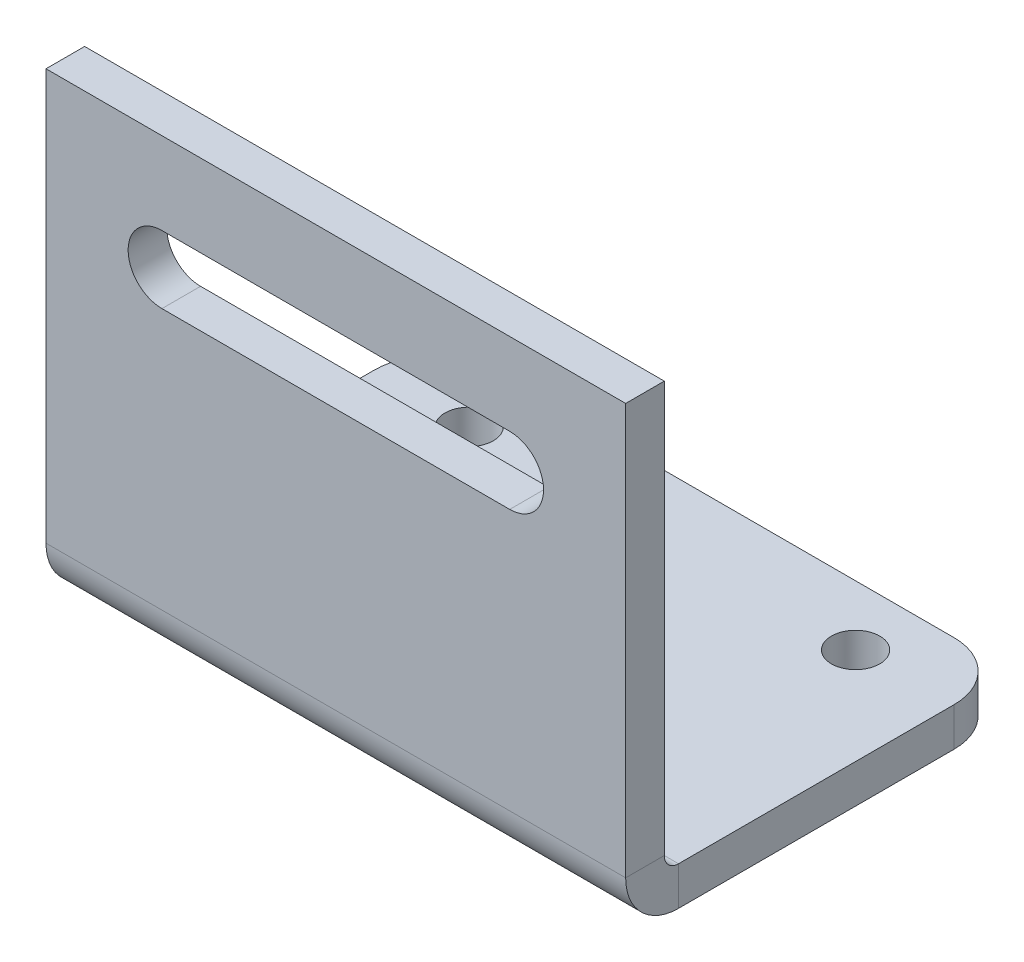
ISO-10303-21;
HEADER;
FILE_DESCRIPTION(('STEP AP214'),'2;1');
FILE_NAME('part.step','',(''),(''),'','','');
FILE_SCHEMA(('AUTOMOTIVE_DESIGN { 1 0 10303 214 1 1 1 1 }'));
ENDSEC;
DATA;
#1=APPLICATION_CONTEXT('core data for automotive mechanical design processes');
#2=APPLICATION_PROTOCOL_DEFINITION('international standard','automotive_design',2000,#1);
#3=PRODUCT_CONTEXT('',#1,'mechanical');
#4=PRODUCT('Part','Part','',(#3));
#5=PRODUCT_RELATED_PRODUCT_CATEGORY('part','',(#4));
#6=PRODUCT_DEFINITION_FORMATION('','',#4);
#7=PRODUCT_DEFINITION_CONTEXT('part definition',#1,'design');
#8=PRODUCT_DEFINITION('design','',#6,#7);
#9=PRODUCT_DEFINITION_SHAPE('','',#8);
#10=(LENGTH_UNIT() NAMED_UNIT(*) SI_UNIT(.MILLI.,.METRE.));
#11=(NAMED_UNIT(*) PLANE_ANGLE_UNIT() SI_UNIT($,.RADIAN.));
#12=(NAMED_UNIT(*) SI_UNIT($,.STERADIAN.) SOLID_ANGLE_UNIT());
#13=UNCERTAINTY_MEASURE_WITH_UNIT(LENGTH_MEASURE(1.E-05),#10,'distance_accuracy_value','');
#14=(GEOMETRIC_REPRESENTATION_CONTEXT(3) GLOBAL_UNCERTAINTY_ASSIGNED_CONTEXT((#13)) GLOBAL_UNIT_ASSIGNED_CONTEXT((#10,
#11,#12)) REPRESENTATION_CONTEXT('',''));
#15=CARTESIAN_POINT('',(0.,0.,0.));
#16=DIRECTION('',(0.,0.,1.));
#17=DIRECTION('',(1.,0.,0.));
#18=AXIS2_PLACEMENT_3D('',#15,#16,#17);
#19=CARTESIAN_POINT('',(146.842788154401,-1.98866400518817E-11,-2.));
#20=DIRECTION('',(-1.,0.,0.));
#21=DIRECTION('',(0.,0.,1.));
#22=AXIS2_PLACEMENT_3D('',#19,#20,#21);
#23=PLANE('',#22);
#24=DIRECTION('',(0.,-1.,0.));
#25=VECTOR('',#24,1.);
#26=CARTESIAN_POINT('',(146.842788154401,-1.98866400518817E-11,-2.));
#27=LINE('',#26,#25);
#28=CARTESIAN_POINT('',(146.842788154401,-1.98866400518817E-11,-2.));
#29=VERTEX_POINT('',#28);
#30=CARTESIAN_POINT('',(146.842788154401,-21.2634000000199,-2.));
#31=VERTEX_POINT('',#30);
#32=EDGE_CURVE('E221',#29,#31,#27,.T.);
#33=ORIENTED_EDGE('',*,*,#32,.T.);
#34=DIRECTION('',(0.,0.,1.));
#35=VECTOR('',#34,1.);
#36=CARTESIAN_POINT('',(146.842788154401,-21.2634000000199,-2.));
#37=LINE('',#36,#35);
#38=CARTESIAN_POINT('',(146.842788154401,-21.2634000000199,0.));
#39=VERTEX_POINT('',#38);
#40=EDGE_CURVE('E205',#31,#39,#37,.T.);
#41=ORIENTED_EDGE('',*,*,#40,.T.);
#42=DIRECTION('',(0.,-1.,0.));
#43=VECTOR('',#42,1.);
#44=CARTESIAN_POINT('',(146.842788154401,-1.98866400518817E-11,0.));
#45=LINE('',#44,#43);
#46=CARTESIAN_POINT('',(146.842788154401,-1.98866400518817E-11,0.));
#47=VERTEX_POINT('',#46);
#48=EDGE_CURVE('E218',#47,#39,#45,.T.);
#49=ORIENTED_EDGE('',*,*,#48,.F.);
#50=DIRECTION('',(0.,0.,1.));
#51=VECTOR('',#50,1.);
#52=CARTESIAN_POINT('',(146.842788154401,-1.98866400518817E-11,-2.));
#53=LINE('',#52,#51);
#54=EDGE_CURVE('E237',#29,#47,#53,.T.);
#55=ORIENTED_EDGE('',*,*,#54,.F.);
#56=EDGE_LOOP('',(#33,#41,#49,#55));
#57=FACE_BOUND('',#56,.T.);
#58=ADVANCED_FACE('F16',(#57),#23,.T.);
#59=CARTESIAN_POINT('',(0.,0.,-2.));
#60=DIRECTION('',(0.,0.,1.));
#61=DIRECTION('',(1.,0.,0.));
#62=AXIS2_PLACEMENT_3D('',#59,#60,#61);
#63=PLANE('',#62);
#64=DIRECTION('',(1.,0.,0.));
#65=VECTOR('',#64,1.);
#66=CARTESIAN_POINT('',(152.842788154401,-4.25000000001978,-2.));
#67=LINE('',#66,#65);
#68=CARTESIAN_POINT('',(152.842788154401,-4.25000000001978,-2.));
#69=VERTEX_POINT('',#68);
#70=CARTESIAN_POINT('',(170.842788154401,-4.25000000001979,-2.));
#71=VERTEX_POINT('',#70);
#72=EDGE_CURVE('E154',#69,#71,#67,.T.);
#73=ORIENTED_EDGE('',*,*,#72,.F.);
#74=CARTESIAN_POINT('',(152.842788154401,-6.00000000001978,-2.));
#75=DIRECTION('',(0.,0.,-1.));
#76=DIRECTION('',(-1.,0.,0.));
#77=AXIS2_PLACEMENT_3D('',#74,#75,#76);
#78=CIRCLE('',#77,1.75);
#79=CARTESIAN_POINT('',(152.842788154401,-7.75000000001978,-2.));
#80=VERTEX_POINT('',#79);
#81=EDGE_CURVE('E127',#80,#69,#78,.T.);
#82=ORIENTED_EDGE('',*,*,#81,.F.);
#83=DIRECTION('',(-1.,0.,0.));
#84=VECTOR('',#83,1.);
#85=CARTESIAN_POINT('',(152.842788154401,-7.75000000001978,-2.));
#86=LINE('',#85,#84);
#87=CARTESIAN_POINT('',(170.842788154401,-7.75000000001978,-2.));
#88=VERTEX_POINT('',#87);
#89=EDGE_CURVE('E145',#88,#80,#86,.T.);
#90=ORIENTED_EDGE('',*,*,#89,.F.);
#91=CARTESIAN_POINT('',(170.842788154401,-6.00000000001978,-2.));
#92=DIRECTION('',(0.,0.,-1.));
#93=DIRECTION('',(-1.,0.,0.));
#94=AXIS2_PLACEMENT_3D('',#91,#92,#93);
#95=CIRCLE('',#94,1.75);
#96=EDGE_CURVE('E148',#71,#88,#95,.T.);
#97=ORIENTED_EDGE('',*,*,#96,.F.);
#98=EDGE_LOOP('',(#73,#82,#90,#97));
#99=FACE_BOUND('',#98,.T.);
#100=DIRECTION('',(-1.,0.,0.));
#101=VECTOR('',#100,1.);
#102=CARTESIAN_POINT('',(146.842788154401,-21.2634000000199,-2.));
#103=LINE('',#102,#101);
#104=CARTESIAN_POINT('',(176.842788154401,-21.2634000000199,-2.));
#105=VERTEX_POINT('',#104);
#106=EDGE_CURVE('E211',#31,#105,#103,.F.);
#107=ORIENTED_EDGE('',*,*,#106,.F.);
#108=ORIENTED_EDGE('',*,*,#32,.F.);
#109=DIRECTION('',(-1.,0.,0.));
#110=VECTOR('',#109,1.);
#111=CARTESIAN_POINT('',(146.842788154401,-1.98866400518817E-11,-2.));
#112=LINE('',#111,#110);
#113=CARTESIAN_POINT('',(176.842788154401,-1.97816611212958E-11,-2.));
#114=VERTEX_POINT('',#113);
#115=EDGE_CURVE('E227',#114,#29,#112,.T.);
#116=ORIENTED_EDGE('',*,*,#115,.F.);
#117=DIRECTION('',(0.,1.,0.));
#118=VECTOR('',#117,1.);
#119=CARTESIAN_POINT('',(176.842788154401,-1.97816611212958E-11,-2.));
#120=LINE('',#119,#118);
#121=EDGE_CURVE('E224',#105,#114,#120,.T.);
#122=ORIENTED_EDGE('',*,*,#121,.F.);
#123=EDGE_LOOP('',(#107,#108,#116,#122));
#124=FACE_BOUND('',#123,.T.);
#125=ADVANCED_FACE('F294',(#99,#124),#63,.F.);
#126=CARTESIAN_POINT('',(0.,0.,0.));
#127=DIRECTION('',(0.,0.,1.));
#128=DIRECTION('',(1.,0.,0.));
#129=AXIS2_PLACEMENT_3D('',#126,#127,#128);
#130=PLANE('',#129);
#131=CARTESIAN_POINT('',(152.842788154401,-6.00000000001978,0.));
#132=DIRECTION('',(0.,0.,-1.));
#133=DIRECTION('',(-1.,0.,0.));
#134=AXIS2_PLACEMENT_3D('',#131,#132,#133);
#135=CIRCLE('',#134,1.75);
#136=CARTESIAN_POINT('',(152.842788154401,-7.75000000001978,0.));
#137=VERTEX_POINT('',#136);
#138=CARTESIAN_POINT('',(152.842788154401,-4.25000000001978,0.));
#139=VERTEX_POINT('',#138);
#140=EDGE_CURVE('E124',#137,#139,#135,.T.);
#141=ORIENTED_EDGE('',*,*,#140,.T.);
#142=DIRECTION('',(1.,0.,0.));
#143=VECTOR('',#142,1.);
#144=CARTESIAN_POINT('',(152.842788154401,-4.25000000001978,0.));
#145=LINE('',#144,#143);
#146=CARTESIAN_POINT('',(170.842788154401,-4.25000000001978,0.));
#147=VERTEX_POINT('',#146);
#148=EDGE_CURVE('E136',#139,#147,#145,.T.);
#149=ORIENTED_EDGE('',*,*,#148,.T.);
#150=CARTESIAN_POINT('',(170.842788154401,-6.00000000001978,0.));
#151=DIRECTION('',(0.,0.,-1.));
#152=DIRECTION('',(-1.,0.,0.));
#153=AXIS2_PLACEMENT_3D('',#150,#151,#152);
#154=CIRCLE('',#153,1.75);
#155=CARTESIAN_POINT('',(170.842788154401,-7.75000000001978,0.));
#156=VERTEX_POINT('',#155);
#157=EDGE_CURVE('E140',#147,#156,#154,.T.);
#158=ORIENTED_EDGE('',*,*,#157,.T.);
#159=DIRECTION('',(-1.,0.,0.));
#160=VECTOR('',#159,1.);
#161=CARTESIAN_POINT('',(152.842788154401,-7.75000000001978,0.));
#162=LINE('',#161,#160);
#163=EDGE_CURVE('E132',#156,#137,#162,.T.);
#164=ORIENTED_EDGE('',*,*,#163,.T.);
#165=EDGE_LOOP('',(#141,#149,#158,#164));
#166=FACE_BOUND('',#165,.T.);
#167=ORIENTED_EDGE('',*,*,#48,.T.);
#168=DIRECTION('',(-1.,0.,0.));
#169=VECTOR('',#168,1.);
#170=CARTESIAN_POINT('',(146.842788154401,-21.2634000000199,0.));
#171=LINE('',#170,#169);
#172=CARTESIAN_POINT('',(176.842788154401,-21.2634000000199,0.));
#173=VERTEX_POINT('',#172);
#174=EDGE_CURVE('E198',#39,#173,#171,.F.);
#175=ORIENTED_EDGE('',*,*,#174,.T.);
#176=DIRECTION('',(0.,1.,0.));
#177=VECTOR('',#176,1.);
#178=CARTESIAN_POINT('',(176.842788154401,-1.97816611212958E-11,0.));
#179=LINE('',#178,#177);
#180=CARTESIAN_POINT('',(176.842788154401,-1.97816611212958E-11,0.));
#181=VERTEX_POINT('',#180);
#182=EDGE_CURVE('E233',#173,#181,#179,.T.);
#183=ORIENTED_EDGE('',*,*,#182,.T.);
#184=DIRECTION('',(-1.,0.,0.));
#185=VECTOR('',#184,1.);
#186=CARTESIAN_POINT('',(146.842788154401,-1.98866400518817E-11,0.));
#187=LINE('',#186,#185);
#188=EDGE_CURVE('E225',#181,#47,#187,.T.);
#189=ORIENTED_EDGE('',*,*,#188,.T.);
#190=EDGE_LOOP('',(#167,#175,#183,#189));
#191=FACE_BOUND('',#190,.T.);
#192=ADVANCED_FACE('F142',(#166,#191),#130,.T.);
#193=CARTESIAN_POINT('',(146.842788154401,-1.98866400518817E-11,-2.));
#194=DIRECTION('',(0.,1.,0.));
#195=DIRECTION('',(-1.,0.,0.));
#196=AXIS2_PLACEMENT_3D('',#193,#194,#195);
#197=PLANE('',#196);
#198=ORIENTED_EDGE('',*,*,#188,.F.);
#199=DIRECTION('',(0.,0.,1.));
#200=VECTOR('',#199,1.);
#201=CARTESIAN_POINT('',(176.842788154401,-1.97816611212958E-11,-2.));
#202=LINE('',#201,#200);
#203=EDGE_CURVE('E230',#114,#181,#202,.T.);
#204=ORIENTED_EDGE('',*,*,#203,.F.);
#205=ORIENTED_EDGE('',*,*,#115,.T.);
#206=ORIENTED_EDGE('',*,*,#54,.T.);
#207=EDGE_LOOP('',(#198,#204,#205,#206));
#208=FACE_BOUND('',#207,.T.);
#209=ADVANCED_FACE('F298',(#208),#197,.T.);
#210=CARTESIAN_POINT('',(176.842788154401,-1.97816611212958E-11,-2.));
#211=DIRECTION('',(1.,0.,0.));
#212=DIRECTION('',(0.,0.,-1.));
#213=AXIS2_PLACEMENT_3D('',#210,#211,#212);
#214=PLANE('',#213);
#215=DIRECTION('',(0.,0.,1.));
#216=VECTOR('',#215,1.);
#217=CARTESIAN_POINT('',(176.842788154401,-21.2634000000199,-2.));
#218=LINE('',#217,#216);
#219=EDGE_CURVE('E215',#105,#173,#218,.T.);
#220=ORIENTED_EDGE('',*,*,#219,.F.);
#221=ORIENTED_EDGE('',*,*,#121,.T.);
#222=ORIENTED_EDGE('',*,*,#203,.T.);
#223=ORIENTED_EDGE('',*,*,#182,.F.);
#224=EDGE_LOOP('',(#220,#221,#222,#223));
#225=FACE_BOUND('',#224,.T.);
#226=ADVANCED_FACE('F290',(#225),#214,.T.);
#227=CARTESIAN_POINT('',(176.842788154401,-21.2634000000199,-2.7366));
#228=DIRECTION('',(1.,0.,0.));
#229=DIRECTION('',(0.,0.,-1.));
#230=AXIS2_PLACEMENT_3D('',#227,#228,#229);
#231=PLANE('',#230);
#232=DIRECTION('',(0.,1.,0.));
#233=VECTOR('',#232,1.);
#234=CARTESIAN_POINT('',(176.842788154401,-24.0000000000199,-2.7366));
#235=LINE('',#234,#233);
#236=CARTESIAN_POINT('',(176.842788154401,-22.0000000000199,-2.7366));
#237=VERTEX_POINT('',#236);
#238=CARTESIAN_POINT('',(176.842788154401,-24.0000000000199,-2.7366));
#239=VERTEX_POINT('',#238);
#240=EDGE_CURVE('E173',#237,#239,#235,.F.);
#241=ORIENTED_EDGE('',*,*,#240,.F.);
#242=CARTESIAN_POINT('',(176.842788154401,-21.2634000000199,-2.7366));
#243=DIRECTION('',(-1.,0.,0.));
#244=DIRECTION('',(0.,0.,1.));
#245=AXIS2_PLACEMENT_3D('',#242,#243,#244);
#246=CIRCLE('',#245,0.7366);
#247=EDGE_CURVE('E208',#105,#237,#246,.F.);
#248=ORIENTED_EDGE('',*,*,#247,.F.);
#249=ORIENTED_EDGE('',*,*,#219,.T.);
#250=CARTESIAN_POINT('',(176.842788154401,-21.2634000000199,-2.7366));
#251=DIRECTION('',(-1.,0.,0.));
#252=DIRECTION('',(0.,0.,1.));
#253=AXIS2_PLACEMENT_3D('',#250,#251,#252);
#254=CIRCLE('',#253,2.7366);
#255=EDGE_CURVE('E201',#173,#239,#254,.F.);
#256=ORIENTED_EDGE('',*,*,#255,.T.);
#257=EDGE_LOOP('',(#241,#248,#249,#256));
#258=FACE_BOUND('',#257,.T.);
#259=ADVANCED_FACE('F277',(#258),#231,.T.);
#260=CARTESIAN_POINT('',(146.842788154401,-21.2634000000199,-2.7366));
#261=DIRECTION('',(1.,0.,0.));
#262=DIRECTION('',(0.,0.,-1.));
#263=AXIS2_PLACEMENT_3D('',#260,#261,#262);
#264=PLANE('',#263);
#265=CARTESIAN_POINT('',(146.842788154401,-21.2634000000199,-2.7366));
#266=DIRECTION('',(-1.,0.,0.));
#267=DIRECTION('',(0.,0.,1.));
#268=AXIS2_PLACEMENT_3D('',#265,#266,#267);
#269=CIRCLE('',#268,0.7366);
#270=CARTESIAN_POINT('',(146.842788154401,-22.0000000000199,-2.7366));
#271=VERTEX_POINT('',#270);
#272=EDGE_CURVE('E176',#271,#31,#269,.T.);
#273=ORIENTED_EDGE('',*,*,#272,.F.);
#274=DIRECTION('',(0.,1.,0.));
#275=VECTOR('',#274,1.);
#276=CARTESIAN_POINT('',(146.842788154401,-22.0000000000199,-2.7366));
#277=LINE('',#276,#275);
#278=CARTESIAN_POINT('',(146.842788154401,-24.0000000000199,-2.7366));
#279=VERTEX_POINT('',#278);
#280=EDGE_CURVE('E191',#271,#279,#277,.F.);
#281=ORIENTED_EDGE('',*,*,#280,.T.);
#282=CARTESIAN_POINT('',(146.842788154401,-21.2634000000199,-2.7366));
#283=DIRECTION('',(-1.,0.,0.));
#284=DIRECTION('',(0.,0.,1.));
#285=AXIS2_PLACEMENT_3D('',#282,#283,#284);
#286=CIRCLE('',#285,2.7366);
#287=EDGE_CURVE('E202',#279,#39,#286,.T.);
#288=ORIENTED_EDGE('',*,*,#287,.T.);
#289=ORIENTED_EDGE('',*,*,#40,.F.);
#290=EDGE_LOOP('',(#273,#281,#288,#289));
#291=FACE_BOUND('',#290,.T.);
#292=ADVANCED_FACE('F272',(#291),#264,.F.);
#293=CARTESIAN_POINT('',(146.842788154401,-21.2634000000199,-2.7366));
#294=DIRECTION('',(-1.,0.,0.));
#295=DIRECTION('',(0.,-1.,0.));
#296=AXIS2_PLACEMENT_3D('',#293,#294,#295);
#297=CYLINDRICAL_SURFACE('',#296,2.7366);
#298=ORIENTED_EDGE('',*,*,#174,.F.);
#299=ORIENTED_EDGE('',*,*,#287,.F.);
#300=DIRECTION('',(-1.,0.,0.));
#301=VECTOR('',#300,1.);
#302=CARTESIAN_POINT('',(176.842788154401,-24.0000000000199,-2.7366));
#303=LINE('',#302,#301);
#304=EDGE_CURVE('E188',#279,#239,#303,.F.);
#305=ORIENTED_EDGE('',*,*,#304,.T.);
#306=ORIENTED_EDGE('',*,*,#255,.F.);
#307=EDGE_LOOP('',(#298,#299,#305,#306));
#308=FACE_BOUND('',#307,.T.);
#309=ADVANCED_FACE('F274',(#308),#297,.T.);
#310=CARTESIAN_POINT('',(146.842788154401,-21.2634000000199,-2.7366));
#311=DIRECTION('',(-1.,0.,0.));
#312=DIRECTION('',(0.,-1.,0.));
#313=AXIS2_PLACEMENT_3D('',#310,#311,#312);
#314=CYLINDRICAL_SURFACE('',#313,0.7366);
#315=ORIENTED_EDGE('',*,*,#106,.T.);
#316=ORIENTED_EDGE('',*,*,#247,.T.);
#317=DIRECTION('',(-1.,0.,0.));
#318=VECTOR('',#317,1.);
#319=CARTESIAN_POINT('',(176.842788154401,-22.0000000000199,-2.7366));
#320=LINE('',#319,#318);
#321=EDGE_CURVE('E194',#237,#271,#320,.T.);
#322=ORIENTED_EDGE('',*,*,#321,.T.);
#323=ORIENTED_EDGE('',*,*,#272,.T.);
#324=EDGE_LOOP('',(#315,#316,#322,#323));
#325=FACE_BOUND('',#324,.T.);
#326=ADVANCED_FACE('F285',(#325),#314,.F.);
#327=CARTESIAN_POINT('',(146.842788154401,-24.0000000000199,-20.));
#328=DIRECTION('',(1.,0.,0.));
#329=DIRECTION('',(0.,0.,-1.));
#330=AXIS2_PLACEMENT_3D('',#327,#328,#329);
#331=PLANE('',#330);
#332=DIRECTION('',(0.,0.,1.));
#333=VECTOR('',#332,1.);
#334=CARTESIAN_POINT('',(146.842788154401,-22.0000000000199,-20.));
#335=LINE('',#334,#333);
#336=CARTESIAN_POINT('',(146.842788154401,-22.0000000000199,-17.));
#337=VERTEX_POINT('',#336);
#338=EDGE_CURVE('E186',#271,#337,#335,.F.);
#339=ORIENTED_EDGE('',*,*,#338,.T.);
#340=DIRECTION('',(0.,1.,0.));
#341=VECTOR('',#340,1.);
#342=CARTESIAN_POINT('',(146.842788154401,-24.0000000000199,-17.));
#343=LINE('',#342,#341);
#344=CARTESIAN_POINT('',(146.842788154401,-24.0000000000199,-17.));
#345=VERTEX_POINT('',#344);
#346=EDGE_CURVE('E39',#337,#345,#343,.F.);
#347=ORIENTED_EDGE('',*,*,#346,.T.);
#348=DIRECTION('',(0.,0.,-1.));
#349=VECTOR('',#348,1.);
#350=CARTESIAN_POINT('',(146.842788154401,-24.0000000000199,-5.89034662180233E-13));
#351=LINE('',#350,#349);
#352=EDGE_CURVE('E179',#279,#345,#351,.T.);
#353=ORIENTED_EDGE('',*,*,#352,.F.);
#354=ORIENTED_EDGE('',*,*,#280,.F.);
#355=EDGE_LOOP('',(#339,#347,#353,#354));
#356=FACE_BOUND('',#355,.T.);
#357=ADVANCED_FACE('F269',(#356),#331,.F.);
#358=CARTESIAN_POINT('',(176.842788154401,-24.0000000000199,-2.));
#359=DIRECTION('',(-1.,0.,0.));
#360=DIRECTION('',(0.,0.,1.));
#361=AXIS2_PLACEMENT_3D('',#358,#359,#360);
#362=PLANE('',#361);
#363=DIRECTION('',(0.,0.,1.));
#364=VECTOR('',#363,1.);
#365=CARTESIAN_POINT('',(176.842788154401,-24.0000000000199,-7.27812540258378E-13));
#366=LINE('',#365,#364);
#367=CARTESIAN_POINT('',(176.842788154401,-24.0000000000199,-17.));
#368=VERTEX_POINT('',#367);
#369=EDGE_CURVE('E174',#368,#239,#366,.T.);
#370=ORIENTED_EDGE('',*,*,#369,.F.);
#371=DIRECTION('',(0.,1.,0.));
#372=VECTOR('',#371,1.);
#373=CARTESIAN_POINT('',(176.842788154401,-24.0000000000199,-17.));
#374=LINE('',#373,#372);
#375=CARTESIAN_POINT('',(176.842788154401,-22.0000000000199,-17.));
#376=VERTEX_POINT('',#375);
#377=EDGE_CURVE('E11',#368,#376,#374,.T.);
#378=ORIENTED_EDGE('',*,*,#377,.T.);
#379=DIRECTION('',(0.,0.,-1.));
#380=VECTOR('',#379,1.);
#381=CARTESIAN_POINT('',(176.842788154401,-22.0000000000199,-2.));
#382=LINE('',#381,#380);
#383=EDGE_CURVE('E181',#376,#237,#382,.F.);
#384=ORIENTED_EDGE('',*,*,#383,.T.);
#385=ORIENTED_EDGE('',*,*,#240,.T.);
#386=EDGE_LOOP('',(#370,#378,#384,#385));
#387=FACE_BOUND('',#386,.T.);
#388=ADVANCED_FACE('F281',(#387),#362,.F.);
#389=CARTESIAN_POINT('',(0.,-24.0000000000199,0.));
#390=DIRECTION('',(0.,1.,0.));
#391=DIRECTION('',(0.,0.,1.));
#392=AXIS2_PLACEMENT_3D('',#389,#390,#391);
#393=PLANE('',#392);
#394=CARTESIAN_POINT('',(171.842788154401,-24.0000000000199,-16.9));
#395=DIRECTION('',(0.,-1.,0.));
#396=DIRECTION('',(0.,0.,-1.));
#397=AXIS2_PLACEMENT_3D('',#394,#395,#396);
#398=CIRCLE('',#397,1.25);
#399=CARTESIAN_POINT('',(171.842788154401,-24.0000000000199,-18.15));
#400=VERTEX_POINT('',#399);
#401=EDGE_CURVE('E160',#400,#400,#398,.T.);
#402=ORIENTED_EDGE('',*,*,#401,.F.);
#403=EDGE_LOOP('',(#402));
#404=FACE_BOUND('',#403,.T.);
#405=CARTESIAN_POINT('',(151.842788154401,-24.0000000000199,-16.9));
#406=DIRECTION('',(0.,-1.,0.));
#407=DIRECTION('',(0.,0.,-1.));
#408=AXIS2_PLACEMENT_3D('',#405,#406,#407);
#409=CIRCLE('',#408,1.24999999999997);
#410=CARTESIAN_POINT('',(151.842788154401,-24.0000000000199,-18.15));
#411=VERTEX_POINT('',#410);
#412=EDGE_CURVE('E167',#411,#411,#409,.T.);
#413=ORIENTED_EDGE('',*,*,#412,.F.);
#414=EDGE_LOOP('',(#413));
#415=FACE_BOUND('',#414,.T.);
#416=ORIENTED_EDGE('',*,*,#352,.T.);
#417=CARTESIAN_POINT('',(149.842788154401,-24.0000000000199,-17.));
#418=DIRECTION('',(0.,1.,0.));
#419=DIRECTION('',(0.,0.,1.));
#420=AXIS2_PLACEMENT_3D('',#417,#418,#419);
#421=CIRCLE('',#420,3.);
#422=CARTESIAN_POINT('',(149.842788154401,-24.0000000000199,-20.));
#423=VERTEX_POINT('',#422);
#424=EDGE_CURVE('E24',#345,#423,#421,.F.);
#425=ORIENTED_EDGE('',*,*,#424,.T.);
#426=DIRECTION('',(1.,0.,0.));
#427=VECTOR('',#426,1.);
#428=CARTESIAN_POINT('',(0.,-24.0000000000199,-20.));
#429=LINE('',#428,#427);
#430=CARTESIAN_POINT('',(173.842788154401,-24.0000000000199,-20.));
#431=VERTEX_POINT('',#430);
#432=EDGE_CURVE('E177',#423,#431,#429,.T.);
#433=ORIENTED_EDGE('',*,*,#432,.T.);
#434=CARTESIAN_POINT('',(173.842788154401,-24.0000000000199,-17.));
#435=DIRECTION('',(0.,1.,0.));
#436=DIRECTION('',(0.,0.,1.));
#437=AXIS2_PLACEMENT_3D('',#434,#435,#436);
#438=CIRCLE('',#437,3.);
#439=EDGE_CURVE('E31',#431,#368,#438,.F.);
#440=ORIENTED_EDGE('',*,*,#439,.T.);
#441=ORIENTED_EDGE('',*,*,#369,.T.);
#442=ORIENTED_EDGE('',*,*,#304,.F.);
#443=EDGE_LOOP('',(#416,#425,#433,#440,#441,#442));
#444=FACE_BOUND('',#443,.T.);
#445=ADVANCED_FACE('F255',(#404,#415,#444),#393,.F.);
#446=CARTESIAN_POINT('',(0.,-22.0000000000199,0.));
#447=DIRECTION('',(0.,1.,0.));
#448=DIRECTION('',(0.,0.,1.));
#449=AXIS2_PLACEMENT_3D('',#446,#447,#448);
#450=PLANE('',#449);
#451=CARTESIAN_POINT('',(171.842788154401,-22.0000000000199,-16.9));
#452=DIRECTION('',(0.,1.,0.));
#453=DIRECTION('',(0.,0.,1.));
#454=AXIS2_PLACEMENT_3D('',#451,#452,#453);
#455=CIRCLE('',#454,1.25);
#456=CARTESIAN_POINT('',(171.842788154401,-22.0000000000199,-15.65));
#457=VERTEX_POINT('',#456);
#458=EDGE_CURVE('E166',#457,#457,#455,.T.);
#459=ORIENTED_EDGE('',*,*,#458,.F.);
#460=EDGE_LOOP('',(#459));
#461=FACE_BOUND('',#460,.T.);
#462=CARTESIAN_POINT('',(151.842788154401,-22.0000000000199,-16.9));
#463=DIRECTION('',(0.,1.,0.));
#464=DIRECTION('',(0.,0.,1.));
#465=AXIS2_PLACEMENT_3D('',#462,#463,#464);
#466=CIRCLE('',#465,1.24999999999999);
#467=CARTESIAN_POINT('',(151.842788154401,-22.0000000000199,-15.65));
#468=VERTEX_POINT('',#467);
#469=EDGE_CURVE('E170',#468,#468,#466,.T.);
#470=ORIENTED_EDGE('',*,*,#469,.F.);
#471=EDGE_LOOP('',(#470));
#472=FACE_BOUND('',#471,.T.);
#473=DIRECTION('',(-1.,0.,0.));
#474=VECTOR('',#473,1.);
#475=CARTESIAN_POINT('',(176.842788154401,-22.0000000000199,-20.));
#476=LINE('',#475,#474);
#477=CARTESIAN_POINT('',(149.842788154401,-22.0000000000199,-20.));
#478=VERTEX_POINT('',#477);
#479=CARTESIAN_POINT('',(173.842788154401,-22.0000000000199,-20.));
#480=VERTEX_POINT('',#479);
#481=EDGE_CURVE('E183',#478,#480,#476,.F.);
#482=ORIENTED_EDGE('',*,*,#481,.F.);
#483=CARTESIAN_POINT('',(149.842788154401,-22.0000000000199,-17.));
#484=DIRECTION('',(0.,1.,0.));
#485=DIRECTION('',(0.,0.,1.));
#486=AXIS2_PLACEMENT_3D('',#483,#484,#485);
#487=CIRCLE('',#486,3.);
#488=EDGE_CURVE('E250',#478,#337,#487,.T.);
#489=ORIENTED_EDGE('',*,*,#488,.T.);
#490=ORIENTED_EDGE('',*,*,#338,.F.);
#491=ORIENTED_EDGE('',*,*,#321,.F.);
#492=ORIENTED_EDGE('',*,*,#383,.F.);
#493=CARTESIAN_POINT('',(173.842788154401,-22.0000000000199,-17.));
#494=DIRECTION('',(0.,1.,0.));
#495=DIRECTION('',(0.,0.,1.));
#496=AXIS2_PLACEMENT_3D('',#493,#494,#495);
#497=CIRCLE('',#496,3.);
#498=EDGE_CURVE('E248',#376,#480,#497,.T.);
#499=ORIENTED_EDGE('',*,*,#498,.T.);
#500=EDGE_LOOP('',(#482,#489,#490,#491,#492,#499));
#501=FACE_BOUND('',#500,.T.);
#502=ADVANCED_FACE('F266',(#461,#472,#501),#450,.T.);
#503=CARTESIAN_POINT('',(176.842788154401,-24.0000000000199,-20.));
#504=DIRECTION('',(0.,0.,1.));
#505=DIRECTION('',(0.,-1.,0.));
#506=AXIS2_PLACEMENT_3D('',#503,#504,#505);
#507=PLANE('',#506);
#508=ORIENTED_EDGE('',*,*,#432,.F.);
#509=DIRECTION('',(0.,1.,0.));
#510=VECTOR('',#509,1.);
#511=CARTESIAN_POINT('',(149.842788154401,-24.0000000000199,-20.));
#512=LINE('',#511,#510);
#513=EDGE_CURVE('E245',#423,#478,#512,.T.);
#514=ORIENTED_EDGE('',*,*,#513,.T.);
#515=ORIENTED_EDGE('',*,*,#481,.T.);
#516=DIRECTION('',(0.,1.,0.));
#517=VECTOR('',#516,1.);
#518=CARTESIAN_POINT('',(173.842788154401,-24.0000000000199,-20.));
#519=LINE('',#518,#517);
#520=EDGE_CURVE('E239',#480,#431,#519,.F.);
#521=ORIENTED_EDGE('',*,*,#520,.T.);
#522=EDGE_LOOP('',(#508,#514,#515,#521));
#523=FACE_BOUND('',#522,.T.);
#524=ADVANCED_FACE('F260',(#523),#507,.F.);
#525=CARTESIAN_POINT('',(151.842788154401,-24.0000000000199,-16.9));
#526=DIRECTION('',(0.,-1.,0.));
#527=DIRECTION('',(0.,0.,-1.));
#528=AXIS2_PLACEMENT_3D('',#525,#526,#527);
#529=CYLINDRICAL_SURFACE('',#528,1.24999999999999);
#530=ORIENTED_EDGE('',*,*,#469,.T.);
#531=EDGE_LOOP('',(#530));
#532=FACE_BOUND('',#531,.T.);
#533=ORIENTED_EDGE('',*,*,#412,.T.);
#534=EDGE_LOOP('',(#533));
#535=FACE_BOUND('',#534,.T.);
#536=ADVANCED_FACE('F335',(#532,#535),#529,.F.);
#537=CARTESIAN_POINT('',(171.842788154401,-24.0000000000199,-16.9));
#538=DIRECTION('',(0.,-1.,0.));
#539=DIRECTION('',(0.,0.,-1.));
#540=AXIS2_PLACEMENT_3D('',#537,#538,#539);
#541=CYLINDRICAL_SURFACE('',#540,1.25);
#542=ORIENTED_EDGE('',*,*,#458,.T.);
#543=EDGE_LOOP('',(#542));
#544=FACE_BOUND('',#543,.T.);
#545=ORIENTED_EDGE('',*,*,#401,.T.);
#546=EDGE_LOOP('',(#545));
#547=FACE_BOUND('',#546,.T.);
#548=ADVANCED_FACE('F332',(#544,#547),#541,.F.);
#549=CARTESIAN_POINT('',(152.842788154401,-6.00000000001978,0.));
#550=DIRECTION('',(0.,0.,-1.));
#551=DIRECTION('',(-1.,0.,0.));
#552=AXIS2_PLACEMENT_3D('',#549,#550,#551);
#553=CYLINDRICAL_SURFACE('',#552,1.75);
#554=ORIENTED_EDGE('',*,*,#81,.T.);
#555=DIRECTION('',(0.,0.,-1.));
#556=VECTOR('',#555,1.);
#557=CARTESIAN_POINT('',(152.842788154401,-4.25000000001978,0.));
#558=LINE('',#557,#556);
#559=EDGE_CURVE('E120',#139,#69,#558,.T.);
#560=ORIENTED_EDGE('',*,*,#559,.F.);
#561=ORIENTED_EDGE('',*,*,#140,.F.);
#562=DIRECTION('',(0.,0.,-1.));
#563=VECTOR('',#562,1.);
#564=CARTESIAN_POINT('',(152.842788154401,-7.75000000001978,0.));
#565=LINE('',#564,#563);
#566=EDGE_CURVE('E158',#137,#80,#565,.T.);
#567=ORIENTED_EDGE('',*,*,#566,.T.);
#568=EDGE_LOOP('',(#554,#560,#561,#567));
#569=FACE_BOUND('',#568,.T.);
#570=ADVANCED_FACE('F122',(#569),#553,.F.);
#571=CARTESIAN_POINT('',(152.842788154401,-7.75000000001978,0.));
#572=DIRECTION('',(0.,-1.,0.));
#573=DIRECTION('',(1.,0.,0.));
#574=AXIS2_PLACEMENT_3D('',#571,#572,#573);
#575=PLANE('',#574);
#576=ORIENTED_EDGE('',*,*,#89,.T.);
#577=ORIENTED_EDGE('',*,*,#566,.F.);
#578=ORIENTED_EDGE('',*,*,#163,.F.);
#579=DIRECTION('',(0.,0.,-1.));
#580=VECTOR('',#579,1.);
#581=CARTESIAN_POINT('',(170.842788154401,-7.75000000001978,0.));
#582=LINE('',#581,#580);
#583=EDGE_CURVE('E161',#156,#88,#582,.T.);
#584=ORIENTED_EDGE('',*,*,#583,.T.);
#585=EDGE_LOOP('',(#576,#577,#578,#584));
#586=FACE_BOUND('',#585,.T.);
#587=ADVANCED_FACE('F325',(#586),#575,.F.);
#588=CARTESIAN_POINT('',(170.842788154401,-6.00000000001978,0.));
#589=DIRECTION('',(0.,0.,-1.));
#590=DIRECTION('',(-1.,0.,0.));
#591=AXIS2_PLACEMENT_3D('',#588,#589,#590);
#592=CYLINDRICAL_SURFACE('',#591,1.75);
#593=ORIENTED_EDGE('',*,*,#96,.T.);
#594=ORIENTED_EDGE('',*,*,#583,.F.);
#595=ORIENTED_EDGE('',*,*,#157,.F.);
#596=DIRECTION('',(0.,0.,-1.));
#597=VECTOR('',#596,1.);
#598=CARTESIAN_POINT('',(170.842788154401,-4.25000000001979,0.));
#599=LINE('',#598,#597);
#600=EDGE_CURVE('E131',#147,#71,#599,.T.);
#601=ORIENTED_EDGE('',*,*,#600,.T.);
#602=EDGE_LOOP('',(#593,#594,#595,#601));
#603=FACE_BOUND('',#602,.T.);
#604=ADVANCED_FACE('F319',(#603),#592,.F.);
#605=CARTESIAN_POINT('',(152.842788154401,-4.25000000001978,0.));
#606=DIRECTION('',(0.,1.,0.));
#607=DIRECTION('',(-1.,0.,0.));
#608=AXIS2_PLACEMENT_3D('',#605,#606,#607);
#609=PLANE('',#608);
#610=ORIENTED_EDGE('',*,*,#72,.T.);
#611=ORIENTED_EDGE('',*,*,#600,.F.);
#612=ORIENTED_EDGE('',*,*,#148,.F.);
#613=ORIENTED_EDGE('',*,*,#559,.T.);
#614=EDGE_LOOP('',(#610,#611,#612,#613));
#615=FACE_BOUND('',#614,.T.);
#616=ADVANCED_FACE('F137',(#615),#609,.F.);
#617=CARTESIAN_POINT('',(149.842788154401,-24.0000000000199,-17.));
#618=DIRECTION('',(0.,1.,0.));
#619=DIRECTION('',(0.,0.,1.));
#620=AXIS2_PLACEMENT_3D('',#617,#618,#619);
#621=CYLINDRICAL_SURFACE('',#620,3.);
#622=ORIENTED_EDGE('',*,*,#424,.F.);
#623=ORIENTED_EDGE('',*,*,#346,.F.);
#624=ORIENTED_EDGE('',*,*,#488,.F.);
#625=ORIENTED_EDGE('',*,*,#513,.F.);
#626=EDGE_LOOP('',(#622,#623,#624,#625));
#627=FACE_BOUND('',#626,.T.);
#628=ADVANCED_FACE('F263',(#627),#621,.T.);
#629=CARTESIAN_POINT('',(173.842788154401,-24.0000000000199,-17.));
#630=DIRECTION('',(0.,1.,0.));
#631=DIRECTION('',(0.,0.,1.));
#632=AXIS2_PLACEMENT_3D('',#629,#630,#631);
#633=CYLINDRICAL_SURFACE('',#632,3.);
#634=ORIENTED_EDGE('',*,*,#439,.F.);
#635=ORIENTED_EDGE('',*,*,#520,.F.);
#636=ORIENTED_EDGE('',*,*,#498,.F.);
#637=ORIENTED_EDGE('',*,*,#377,.F.);
#638=EDGE_LOOP('',(#634,#635,#636,#637));
#639=FACE_BOUND('',#638,.T.);
#640=ADVANCED_FACE('F18',(#639),#633,.T.);
#641=CLOSED_SHELL('',(#58,#125,#192,#209,#226,#259,#292,#309,#326,#357,#388,#445,#502,#524,#536,
#548,#570,#587,#604,#616,#628,#640));
#642=MANIFOLD_SOLID_BREP('B1',#641);
#643=ADVANCED_BREP_SHAPE_REPRESENTATION('',(#18,#642),#14);
#644=SHAPE_DEFINITION_REPRESENTATION(#9,#643);
ENDSEC;
END-ISO-10303-21;
